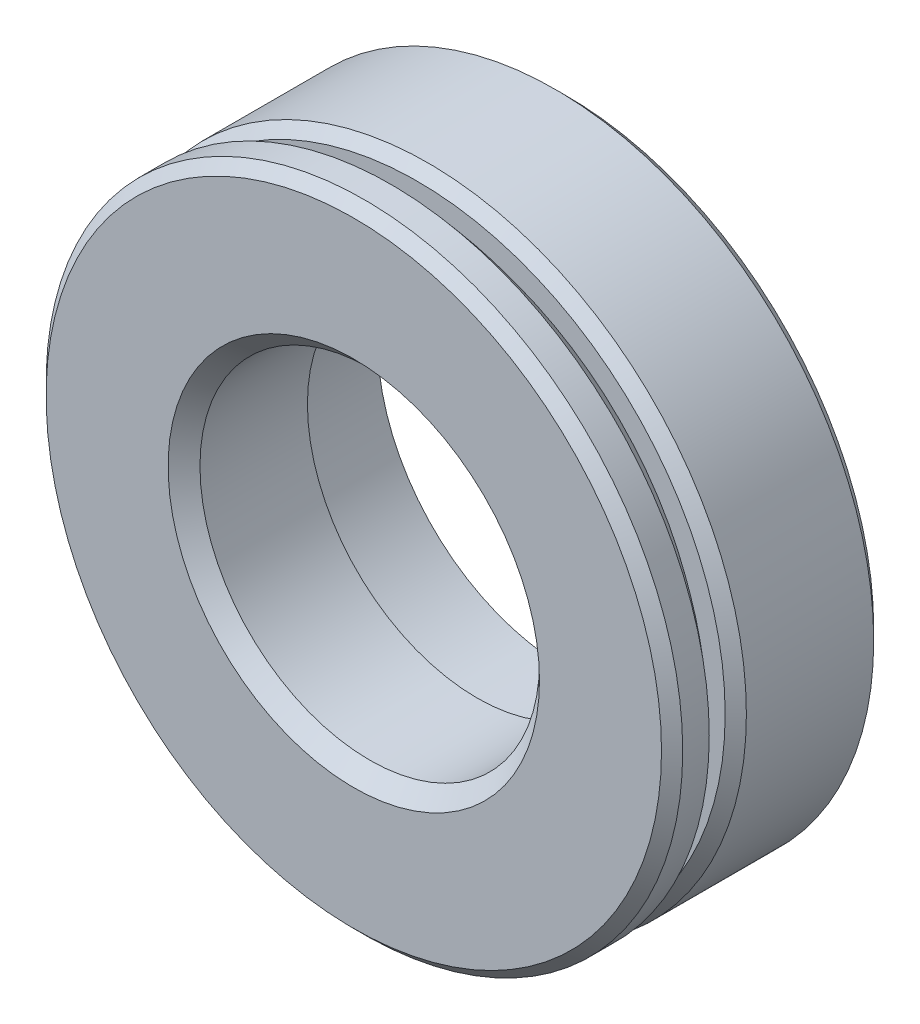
ISO-10303-21;
HEADER;
FILE_DESCRIPTION(('STEP AP214'),'2;1');
FILE_NAME('part.step','',(''),(''),'','','');
FILE_SCHEMA(('AUTOMOTIVE_DESIGN { 1 0 10303 214 1 1 1 1 }'));
ENDSEC;
DATA;
#1=APPLICATION_CONTEXT('core data for automotive mechanical design processes');
#2=APPLICATION_PROTOCOL_DEFINITION('international standard','automotive_design',2000,#1);
#3=PRODUCT_CONTEXT('',#1,'mechanical');
#4=PRODUCT('Part','Part','',(#3));
#5=PRODUCT_RELATED_PRODUCT_CATEGORY('part','',(#4));
#6=PRODUCT_DEFINITION_FORMATION('','',#4);
#7=PRODUCT_DEFINITION_CONTEXT('part definition',#1,'design');
#8=PRODUCT_DEFINITION('design','',#6,#7);
#9=PRODUCT_DEFINITION_SHAPE('','',#8);
#10=(LENGTH_UNIT() NAMED_UNIT(*) SI_UNIT(.MILLI.,.METRE.));
#11=(NAMED_UNIT(*) PLANE_ANGLE_UNIT() SI_UNIT($,.RADIAN.));
#12=(NAMED_UNIT(*) SI_UNIT($,.STERADIAN.) SOLID_ANGLE_UNIT());
#13=UNCERTAINTY_MEASURE_WITH_UNIT(LENGTH_MEASURE(1.E-05),#10,'distance_accuracy_value','');
#14=(GEOMETRIC_REPRESENTATION_CONTEXT(3) GLOBAL_UNCERTAINTY_ASSIGNED_CONTEXT((#13)) GLOBAL_UNIT_ASSIGNED_CONTEXT((#10,
#11,#12)) REPRESENTATION_CONTEXT('',''));
#15=CARTESIAN_POINT('',(0.,0.,0.));
#16=DIRECTION('',(0.,0.,1.));
#17=DIRECTION('',(1.,0.,0.));
#18=AXIS2_PLACEMENT_3D('',#15,#16,#17);
#19=CARTESIAN_POINT('',(0.,0.,6.47416697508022));
#20=DIRECTION('',(0.,0.,1.));
#21=DIRECTION('',(1.,0.,0.));
#22=AXIS2_PLACEMENT_3D('',#19,#20,#21);
#23=CYLINDRICAL_SURFACE('',#22,3.2);
#24=CARTESIAN_POINT('',(0.,0.,1.67416697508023));
#25=DIRECTION('',(0.,0.,1.));
#26=DIRECTION('',(1.,0.,0.));
#27=AXIS2_PLACEMENT_3D('',#24,#25,#26);
#28=CIRCLE('',#27,3.2);
#29=CARTESIAN_POINT('',(3.2,0.,1.67416697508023));
#30=VERTEX_POINT('',#29);
#31=EDGE_CURVE('E8',#30,#30,#28,.T.);
#32=ORIENTED_EDGE('',*,*,#31,.F.);
#33=EDGE_LOOP('',(#32));
#34=FACE_BOUND('',#33,.T.);
#35=CARTESIAN_POINT('',(0.,0.,3.69996697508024));
#36=DIRECTION('',(0.,0.,1.));
#37=DIRECTION('',(1.,0.,0.));
#38=AXIS2_PLACEMENT_3D('',#35,#36,#37);
#39=CIRCLE('',#38,3.2);
#40=CARTESIAN_POINT('',(3.2,0.,3.69996697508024));
#41=VERTEX_POINT('',#40);
#42=EDGE_CURVE('E56',#41,#41,#39,.T.);
#43=ORIENTED_EDGE('',*,*,#42,.T.);
#44=EDGE_LOOP('',(#43));
#45=FACE_BOUND('',#44,.T.);
#46=ADVANCED_FACE('F13',(#34,#45),#23,.F.);
#47=CARTESIAN_POINT('',(-3.2,0.,1.67416697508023));
#48=DIRECTION('',(0.,0.,1.));
#49=DIRECTION('',(1.,0.,0.));
#50=AXIS2_PLACEMENT_3D('',#47,#48,#49);
#51=PLANE('',#50);
#52=CARTESIAN_POINT('',(0.,0.,1.67416697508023));
#53=DIRECTION('',(0.,0.,1.));
#54=DIRECTION('',(1.,0.,0.));
#55=AXIS2_PLACEMENT_3D('',#52,#53,#54);
#56=CIRCLE('',#55,3.55);
#57=CARTESIAN_POINT('',(3.55,0.,1.67416697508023));
#58=VERTEX_POINT('',#57);
#59=EDGE_CURVE('E19',#58,#58,#56,.T.);
#60=ORIENTED_EDGE('',*,*,#59,.F.);
#61=EDGE_LOOP('',(#60));
#62=FACE_BOUND('',#61,.T.);
#63=ORIENTED_EDGE('',*,*,#31,.T.);
#64=EDGE_LOOP('',(#63));
#65=FACE_BOUND('',#64,.T.);
#66=ADVANCED_FACE('F123',(#62,#65),#51,.F.);
#67=CARTESIAN_POINT('',(0.,0.,6.47416697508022));
#68=DIRECTION('',(0.,0.,1.));
#69=DIRECTION('',(1.,0.,0.));
#70=AXIS2_PLACEMENT_3D('',#67,#68,#69);
#71=CYLINDRICAL_SURFACE('',#70,3.55);
#72=CARTESIAN_POINT('',(0.,0.,0.));
#73=DIRECTION('',(0.,0.,1.));
#74=DIRECTION('',(1.,0.,0.));
#75=AXIS2_PLACEMENT_3D('',#72,#73,#74);
#76=CIRCLE('',#75,3.55);
#77=CARTESIAN_POINT('',(3.55,0.,0.));
#78=VERTEX_POINT('',#77);
#79=EDGE_CURVE('E23',#78,#78,#76,.T.);
#80=ORIENTED_EDGE('',*,*,#79,.F.);
#81=EDGE_LOOP('',(#80));
#82=FACE_BOUND('',#81,.T.);
#83=ORIENTED_EDGE('',*,*,#59,.T.);
#84=EDGE_LOOP('',(#83));
#85=FACE_BOUND('',#84,.T.);
#86=ADVANCED_FACE('F118',(#82,#85),#71,.F.);
#87=CARTESIAN_POINT('',(-3.55,0.,0.));
#88=DIRECTION('',(0.,0.,1.));
#89=DIRECTION('',(1.,0.,0.));
#90=AXIS2_PLACEMENT_3D('',#87,#88,#89);
#91=PLANE('',#90);
#92=CARTESIAN_POINT('',(0.,0.,0.));
#93=DIRECTION('',(0.,0.,1.));
#94=DIRECTION('',(1.,0.,0.));
#95=AXIS2_PLACEMENT_3D('',#92,#93,#94);
#96=CIRCLE('',#95,5.8);
#97=CARTESIAN_POINT('',(5.8,0.,0.));
#98=VERTEX_POINT('',#97);
#99=EDGE_CURVE('E27',#98,#98,#96,.T.);
#100=ORIENTED_EDGE('',*,*,#99,.F.);
#101=EDGE_LOOP('',(#100));
#102=FACE_BOUND('',#101,.T.);
#103=ORIENTED_EDGE('',*,*,#79,.T.);
#104=EDGE_LOOP('',(#103));
#105=FACE_BOUND('',#104,.T.);
#106=ADVANCED_FACE('F112',(#102,#105),#91,.F.);
#107=CARTESIAN_POINT('',(0.,0.,0.));
#108=DIRECTION('',(0.,0.,1.));
#109=DIRECTION('',(1.,0.,0.));
#110=AXIS2_PLACEMENT_3D('',#107,#108,#109);
#111=CONICAL_SURFACE('',#110,5.8,0.785398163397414);
#112=CARTESIAN_POINT('',(0.,0.,0.200000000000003));
#113=DIRECTION('',(0.,0.,1.));
#114=DIRECTION('',(1.,0.,0.));
#115=AXIS2_PLACEMENT_3D('',#112,#113,#114);
#116=CIRCLE('',#115,6.);
#117=CARTESIAN_POINT('',(6.,0.,0.200000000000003));
#118=VERTEX_POINT('',#117);
#119=EDGE_CURVE('E32',#118,#118,#116,.T.);
#120=ORIENTED_EDGE('',*,*,#119,.F.);
#121=EDGE_LOOP('',(#120));
#122=FACE_BOUND('',#121,.T.);
#123=ORIENTED_EDGE('',*,*,#99,.T.);
#124=EDGE_LOOP('',(#123));
#125=FACE_BOUND('',#124,.T.);
#126=ADVANCED_FACE('F106',(#122,#125),#111,.T.);
#127=CARTESIAN_POINT('',(0.,0.,6.47416697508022));
#128=DIRECTION('',(0.,0.,1.));
#129=DIRECTION('',(1.,0.,0.));
#130=AXIS2_PLACEMENT_3D('',#127,#128,#129);
#131=CYLINDRICAL_SURFACE('',#130,6.);
#132=CARTESIAN_POINT('',(0.,0.,2.6));
#133=DIRECTION('',(0.,0.,1.));
#134=DIRECTION('',(1.,0.,0.));
#135=AXIS2_PLACEMENT_3D('',#132,#133,#134);
#136=CIRCLE('',#135,6.);
#137=CARTESIAN_POINT('',(6.,0.,2.6));
#138=VERTEX_POINT('',#137);
#139=EDGE_CURVE('E35',#138,#138,#136,.T.);
#140=ORIENTED_EDGE('',*,*,#139,.F.);
#141=EDGE_LOOP('',(#140));
#142=FACE_BOUND('',#141,.T.);
#143=ORIENTED_EDGE('',*,*,#119,.T.);
#144=EDGE_LOOP('',(#143));
#145=FACE_BOUND('',#144,.T.);
#146=ADVANCED_FACE('F100',(#142,#145),#131,.T.);
#147=CARTESIAN_POINT('',(0.,0.,2.6));
#148=DIRECTION('',(0.,0.,-1.));
#149=DIRECTION('',(-1.,0.,0.));
#150=AXIS2_PLACEMENT_3D('',#147,#148,#149);
#151=CONICAL_SURFACE('',#150,6.,0.785398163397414);
#152=CARTESIAN_POINT('',(0.,0.,2.8));
#153=DIRECTION('',(0.,0.,1.));
#154=DIRECTION('',(1.,0.,0.));
#155=AXIS2_PLACEMENT_3D('',#152,#153,#154);
#156=CIRCLE('',#155,5.8);
#157=CARTESIAN_POINT('',(5.8,0.,2.8));
#158=VERTEX_POINT('',#157);
#159=EDGE_CURVE('E38',#158,#158,#156,.T.);
#160=ORIENTED_EDGE('',*,*,#159,.F.);
#161=EDGE_LOOP('',(#160));
#162=FACE_BOUND('',#161,.T.);
#163=ORIENTED_EDGE('',*,*,#139,.T.);
#164=EDGE_LOOP('',(#163));
#165=FACE_BOUND('',#164,.T.);
#166=ADVANCED_FACE('F94',(#162,#165),#151,.T.);
#167=CARTESIAN_POINT('',(-5.38903513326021,0.,2.8));
#168=DIRECTION('',(0.,0.,-1.));
#169=DIRECTION('',(-1.,0.,0.));
#170=AXIS2_PLACEMENT_3D('',#167,#168,#169);
#171=PLANE('',#170);
#172=CARTESIAN_POINT('',(0.,0.,2.8));
#173=DIRECTION('',(0.,0.,1.));
#174=DIRECTION('',(1.,0.,0.));
#175=AXIS2_PLACEMENT_3D('',#172,#173,#174);
#176=CIRCLE('',#175,5.38903513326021);
#177=CARTESIAN_POINT('',(5.38903513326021,0.,2.8));
#178=VERTEX_POINT('',#177);
#179=EDGE_CURVE('E41',#178,#178,#176,.T.);
#180=ORIENTED_EDGE('',*,*,#179,.F.);
#181=EDGE_LOOP('',(#180));
#182=FACE_BOUND('',#181,.T.);
#183=ORIENTED_EDGE('',*,*,#159,.T.);
#184=EDGE_LOOP('',(#183));
#185=FACE_BOUND('',#184,.T.);
#186=ADVANCED_FACE('F88',(#182,#185),#171,.F.);
#187=CARTESIAN_POINT('',(0.,0.,10.0084128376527));
#188=DIRECTION('',(0.,0.,1.));
#189=DIRECTION('',(1.,0.,0.));
#190=AXIS2_PLACEMENT_3D('',#187,#188,#189);
#191=DEGENERATE_TOROIDAL_SURFACE('',#190,0.000270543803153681,8.99999996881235,.T.);
#192=CARTESIAN_POINT('',(0.,0.,3.29996697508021));
#193=DIRECTION('',(0.,0.,1.));
#194=DIRECTION('',(1.,0.,0.));
#195=AXIS2_PLACEMENT_3D('',#192,#193,#194);
#196=CIRCLE('',#195,6.);
#197=CARTESIAN_POINT('',(6.,0.,3.29996697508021));
#198=VERTEX_POINT('',#197);
#199=EDGE_CURVE('E44',#198,#198,#196,.T.);
#200=ORIENTED_EDGE('',*,*,#199,.F.);
#201=EDGE_LOOP('',(#200));
#202=FACE_BOUND('',#201,.T.);
#203=ORIENTED_EDGE('',*,*,#179,.T.);
#204=EDGE_LOOP('',(#203));
#205=FACE_BOUND('',#204,.T.);
#206=ADVANCED_FACE('F82',(#202,#205),#191,.T.);
#207=CARTESIAN_POINT('',(0.,0.,6.47416697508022));
#208=DIRECTION('',(0.,0.,1.));
#209=DIRECTION('',(1.,0.,0.));
#210=AXIS2_PLACEMENT_3D('',#207,#208,#209);
#211=CYLINDRICAL_SURFACE('',#210,6.);
#212=CARTESIAN_POINT('',(0.,0.,3.79996697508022));
#213=DIRECTION('',(0.,0.,1.));
#214=DIRECTION('',(1.,0.,0.));
#215=AXIS2_PLACEMENT_3D('',#212,#213,#214);
#216=CIRCLE('',#215,6.);
#217=CARTESIAN_POINT('',(6.,0.,3.79996697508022));
#218=VERTEX_POINT('',#217);
#219=EDGE_CURVE('E47',#218,#218,#216,.T.);
#220=ORIENTED_EDGE('',*,*,#219,.F.);
#221=EDGE_LOOP('',(#220));
#222=FACE_BOUND('',#221,.T.);
#223=ORIENTED_EDGE('',*,*,#199,.T.);
#224=EDGE_LOOP('',(#223));
#225=FACE_BOUND('',#224,.T.);
#226=ADVANCED_FACE('F76',(#222,#225),#211,.T.);
#227=CARTESIAN_POINT('',(0.,0.,3.79996697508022));
#228=DIRECTION('',(0.,0.,-1.));
#229=DIRECTION('',(-1.,0.,0.));
#230=AXIS2_PLACEMENT_3D('',#227,#228,#229);
#231=CONICAL_SURFACE('',#230,6.,0.785398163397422);
#232=CARTESIAN_POINT('',(0.,0.,3.99996697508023));
#233=DIRECTION('',(0.,0.,1.));
#234=DIRECTION('',(1.,0.,0.));
#235=AXIS2_PLACEMENT_3D('',#232,#233,#234);
#236=CIRCLE('',#235,5.80000000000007);
#237=CARTESIAN_POINT('',(5.80000000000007,0.,3.99996697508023));
#238=VERTEX_POINT('',#237);
#239=EDGE_CURVE('E50',#238,#238,#236,.T.);
#240=ORIENTED_EDGE('',*,*,#239,.F.);
#241=EDGE_LOOP('',(#240));
#242=FACE_BOUND('',#241,.T.);
#243=ORIENTED_EDGE('',*,*,#219,.T.);
#244=EDGE_LOOP('',(#243));
#245=FACE_BOUND('',#244,.T.);
#246=ADVANCED_FACE('F70',(#242,#245),#231,.T.);
#247=CARTESIAN_POINT('',(-5.80000000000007,0.,3.99996697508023));
#248=DIRECTION('',(0.,0.,-1.));
#249=DIRECTION('',(-1.,0.,0.));
#250=AXIS2_PLACEMENT_3D('',#247,#248,#249);
#251=PLANE('',#250);
#252=CARTESIAN_POINT('',(0.,0.,3.99996697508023));
#253=DIRECTION('',(0.,0.,1.));
#254=DIRECTION('',(1.,0.,0.));
#255=AXIS2_PLACEMENT_3D('',#252,#253,#254);
#256=CIRCLE('',#255,3.5);
#257=CARTESIAN_POINT('',(3.5,0.,3.99996697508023));
#258=VERTEX_POINT('',#257);
#259=EDGE_CURVE('E53',#258,#258,#256,.T.);
#260=ORIENTED_EDGE('',*,*,#259,.F.);
#261=EDGE_LOOP('',(#260));
#262=FACE_BOUND('',#261,.T.);
#263=ORIENTED_EDGE('',*,*,#239,.T.);
#264=EDGE_LOOP('',(#263));
#265=FACE_BOUND('',#264,.T.);
#266=ADVANCED_FACE('F64',(#262,#265),#251,.F.);
#267=CARTESIAN_POINT('',(0.,0.,3.99996697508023));
#268=DIRECTION('',(0.,0.,1.));
#269=DIRECTION('',(1.,0.,0.));
#270=AXIS2_PLACEMENT_3D('',#267,#268,#269);
#271=CONICAL_SURFACE('',#270,3.5,0.785398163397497);
#272=ORIENTED_EDGE('',*,*,#42,.F.);
#273=EDGE_LOOP('',(#272));
#274=FACE_BOUND('',#273,.T.);
#275=ORIENTED_EDGE('',*,*,#259,.T.);
#276=EDGE_LOOP('',(#275));
#277=FACE_BOUND('',#276,.T.);
#278=ADVANCED_FACE('F61',(#274,#277),#271,.F.);
#279=CLOSED_SHELL('',(#46,#66,#86,#106,#126,#146,#166,#186,#206,#226,#246,#266,#278));
#280=MANIFOLD_SOLID_BREP('B1',#279);
#281=ADVANCED_BREP_SHAPE_REPRESENTATION('',(#18,#280),#14);
#282=SHAPE_DEFINITION_REPRESENTATION(#9,#281);
ENDSEC;
END-ISO-10303-21;
